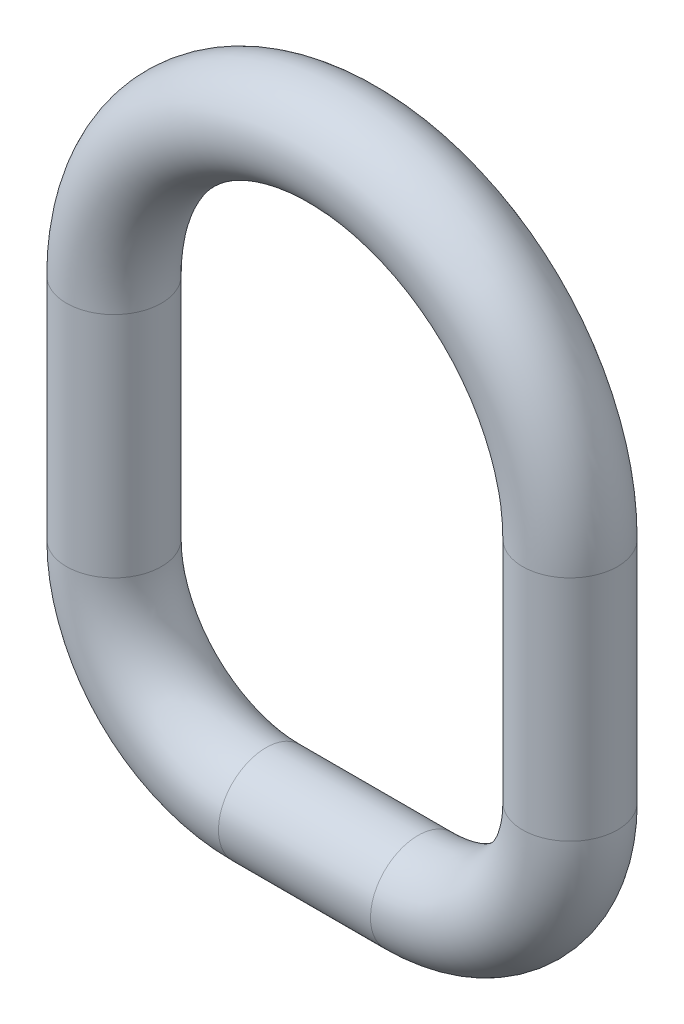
from build123d import *

# Parameters (mm, degrees)
SKETCH2_R = 3.96875


with BuildPart() as part:
    # main: sweep along a path in Sketch1
    with BuildLine(Plane.XY) as main_path:
        Line((0, 0), (6.35, 0))
        ThreePointArc((6.35, 0), (15.330256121, 3.719743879), (19.05, 12.7))
        Line((19.05, 12.7), (19.05, 31.75))
        ThreePointArc((19.05, 31.75), (0, 50.8), (-19.05, 31.75))
        Line((-19.05, 31.75), (-19.05, 12.7))
        ThreePointArc((-19.05, 12.7), (-15.330256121, 3.719743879), (-6.35, 0))
        Line((-6.35, 0), (0, 0))
    # Sketch2 → main (sweep)
    with BuildSketch(Plane(origin=(0, 0, 0), x_dir=(0, 0, -1), z_dir=(1, 0, 0))):
        Circle(SKETCH2_R)
    sweep(path=main_path.line)


solid = part.part
